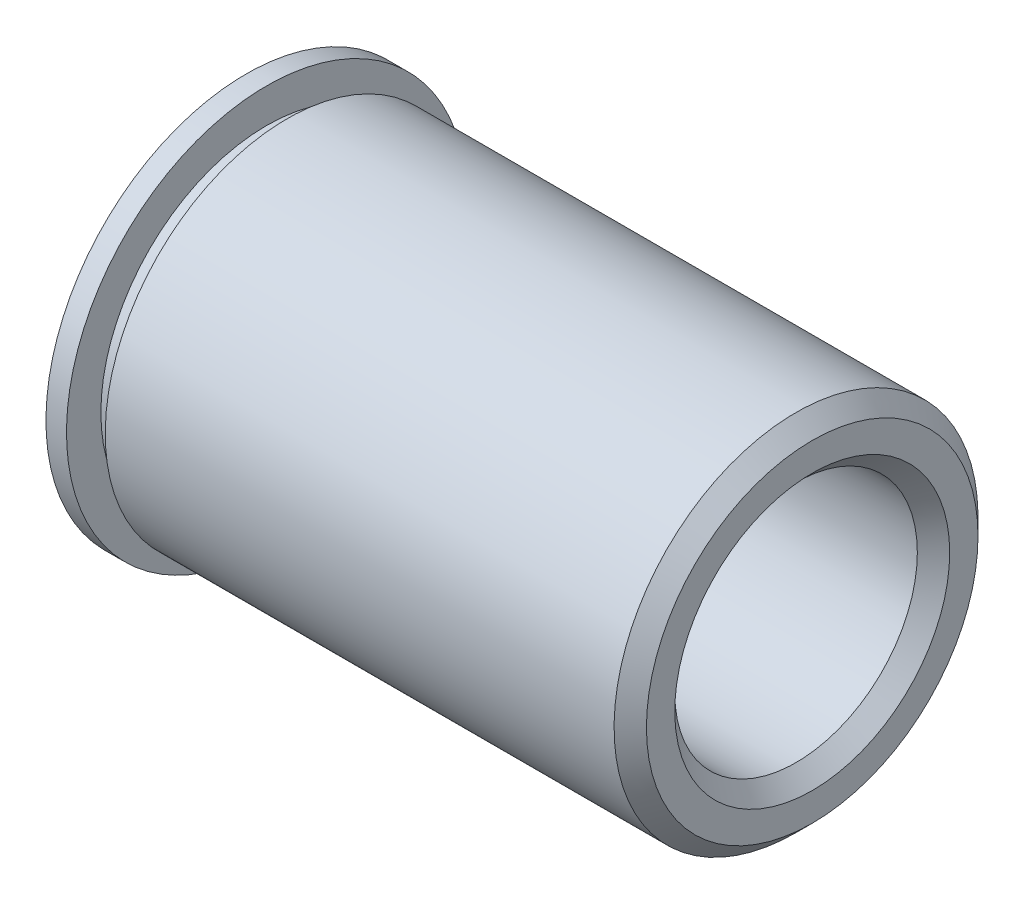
ISO-10303-21;
HEADER;
FILE_DESCRIPTION(('STEP AP214'),'2;1');
FILE_NAME('part.step','',(''),(''),'','','');
FILE_SCHEMA(('AUTOMOTIVE_DESIGN { 1 0 10303 214 1 1 1 1 }'));
ENDSEC;
DATA;
#1=APPLICATION_CONTEXT('core data for automotive mechanical design processes');
#2=APPLICATION_PROTOCOL_DEFINITION('international standard','automotive_design',2000,#1);
#3=PRODUCT_CONTEXT('',#1,'mechanical');
#4=PRODUCT('Part','Part','',(#3));
#5=PRODUCT_RELATED_PRODUCT_CATEGORY('part','',(#4));
#6=PRODUCT_DEFINITION_FORMATION('','',#4);
#7=PRODUCT_DEFINITION_CONTEXT('part definition',#1,'design');
#8=PRODUCT_DEFINITION('design','',#6,#7);
#9=PRODUCT_DEFINITION_SHAPE('','',#8);
#10=(LENGTH_UNIT() NAMED_UNIT(*) SI_UNIT(.MILLI.,.METRE.));
#11=(NAMED_UNIT(*) PLANE_ANGLE_UNIT() SI_UNIT($,.RADIAN.));
#12=(NAMED_UNIT(*) SI_UNIT($,.STERADIAN.) SOLID_ANGLE_UNIT());
#13=UNCERTAINTY_MEASURE_WITH_UNIT(LENGTH_MEASURE(1.E-05),#10,'distance_accuracy_value','');
#14=(GEOMETRIC_REPRESENTATION_CONTEXT(3) GLOBAL_UNCERTAINTY_ASSIGNED_CONTEXT((#13)) GLOBAL_UNIT_ASSIGNED_CONTEXT((#10,
#11,#12)) REPRESENTATION_CONTEXT('',''));
#15=CARTESIAN_POINT('',(0.,0.,0.));
#16=DIRECTION('',(0.,0.,1.));
#17=DIRECTION('',(1.,0.,0.));
#18=AXIS2_PLACEMENT_3D('',#15,#16,#17);
#19=CARTESIAN_POINT('',(76.2136725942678,0.,0.));
#20=DIRECTION('',(-1.,0.,0.));
#21=DIRECTION('',(0.,-1.,0.));
#22=AXIS2_PLACEMENT_3D('',#19,#20,#21);
#23=PLANE('',#22);
#24=CARTESIAN_POINT('',(76.2136725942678,0.,0.));
#25=DIRECTION('',(-1.,0.,0.));
#26=DIRECTION('',(0.,-1.,0.));
#27=AXIS2_PLACEMENT_3D('',#24,#25,#26);
#28=CIRCLE('',#27,1.7);
#29=CARTESIAN_POINT('',(76.2136725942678,-1.7,0.));
#30=VERTEX_POINT('',#29);
#31=EDGE_CURVE('E10',#30,#30,#28,.T.);
#32=ORIENTED_EDGE('',*,*,#31,.T.);
#33=EDGE_LOOP('',(#32));
#34=FACE_BOUND('',#33,.T.);
#35=CARTESIAN_POINT('',(76.2136725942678,0.,0.));
#36=DIRECTION('',(-1.,0.,0.));
#37=DIRECTION('',(0.,-1.,0.));
#38=AXIS2_PLACEMENT_3D('',#35,#36,#37);
#39=CIRCLE('',#38,2.04999999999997);
#40=CARTESIAN_POINT('',(76.2136725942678,-2.04999999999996,0.));
#41=VERTEX_POINT('',#40);
#42=EDGE_CURVE('E52',#41,#41,#39,.F.);
#43=ORIENTED_EDGE('',*,*,#42,.T.);
#44=EDGE_LOOP('',(#43));
#45=FACE_BOUND('',#44,.T.);
#46=ADVANCED_FACE('F32',(#34,#45),#23,.F.);
#47=CARTESIAN_POINT('',(-67.8249023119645,0.,0.));
#48=DIRECTION('',(-1.,0.,0.));
#49=DIRECTION('',(0.,-1.,0.));
#50=AXIS2_PLACEMENT_3D('',#47,#48,#49);
#51=CYLINDRICAL_SURFACE('',#50,2.25);
#52=CARTESIAN_POINT('',(76.0136725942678,0.,0.));
#53=DIRECTION('',(-1.,0.,0.));
#54=DIRECTION('',(0.,-1.,0.));
#55=AXIS2_PLACEMENT_3D('',#52,#53,#54);
#56=CIRCLE('',#55,2.25);
#57=CARTESIAN_POINT('',(76.0136725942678,-2.24999999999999,0.));
#58=VERTEX_POINT('',#57);
#59=EDGE_CURVE('E55',#58,#58,#56,.T.);
#60=ORIENTED_EDGE('',*,*,#59,.T.);
#61=EDGE_LOOP('',(#60));
#62=FACE_BOUND('',#61,.T.);
#63=CARTESIAN_POINT('',(69.7216725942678,0.,0.));
#64=DIRECTION('',(-1.,0.,0.));
#65=DIRECTION('',(0.,-1.,0.));
#66=AXIS2_PLACEMENT_3D('',#63,#64,#65);
#67=CIRCLE('',#66,2.25);
#68=CARTESIAN_POINT('',(69.7216725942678,-2.25,0.));
#69=VERTEX_POINT('',#68);
#70=EDGE_CURVE('E58',#69,#69,#67,.T.);
#71=ORIENTED_EDGE('',*,*,#70,.F.);
#72=EDGE_LOOP('',(#71));
#73=FACE_BOUND('',#72,.T.);
#74=ADVANCED_FACE('F97',(#62,#73),#51,.T.);
#75=CARTESIAN_POINT('',(69.7216725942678,2.25,0.));
#76=DIRECTION('',(1.,0.,0.));
#77=DIRECTION('',(0.,1.,0.));
#78=AXIS2_PLACEMENT_3D('',#75,#76,#77);
#79=PLANE('',#78);
#80=CARTESIAN_POINT('',(69.7216725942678,0.,0.));
#81=DIRECTION('',(-1.,0.,0.));
#82=DIRECTION('',(0.,-1.,0.));
#83=AXIS2_PLACEMENT_3D('',#80,#81,#82);
#84=CIRCLE('',#83,2.05);
#85=CARTESIAN_POINT('',(69.7216725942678,-2.05,0.));
#86=VERTEX_POINT('',#85);
#87=EDGE_CURVE('E61',#86,#86,#84,.T.);
#88=ORIENTED_EDGE('',*,*,#87,.F.);
#89=EDGE_LOOP('',(#88));
#90=FACE_BOUND('',#89,.T.);
#91=ORIENTED_EDGE('',*,*,#70,.T.);
#92=EDGE_LOOP('',(#91));
#93=FACE_BOUND('',#92,.T.);
#94=ADVANCED_FACE('F91',(#90,#93),#79,.F.);
#95=CARTESIAN_POINT('',(-67.8249023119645,0.,0.));
#96=DIRECTION('',(-1.,0.,0.));
#97=DIRECTION('',(0.,-1.,0.));
#98=AXIS2_PLACEMENT_3D('',#95,#96,#97);
#99=CYLINDRICAL_SURFACE('',#98,2.05);
#100=CARTESIAN_POINT('',(69.4676725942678,0.,0.));
#101=DIRECTION('',(-1.,0.,0.));
#102=DIRECTION('',(0.,-1.,0.));
#103=AXIS2_PLACEMENT_3D('',#100,#101,#102);
#104=CIRCLE('',#103,2.05);
#105=CARTESIAN_POINT('',(69.4676725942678,-2.05,0.));
#106=VERTEX_POINT('',#105);
#107=EDGE_CURVE('E64',#106,#106,#104,.T.);
#108=ORIENTED_EDGE('',*,*,#107,.F.);
#109=EDGE_LOOP('',(#108));
#110=FACE_BOUND('',#109,.T.);
#111=ORIENTED_EDGE('',*,*,#87,.T.);
#112=EDGE_LOOP('',(#111));
#113=FACE_BOUND('',#112,.T.);
#114=ADVANCED_FACE('F85',(#110,#113),#99,.T.);
#115=CARTESIAN_POINT('',(69.4676725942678,2.05,0.));
#116=DIRECTION('',(-1.,0.,0.));
#117=DIRECTION('',(0.,-1.,0.));
#118=AXIS2_PLACEMENT_3D('',#115,#116,#117);
#119=PLANE('',#118);
#120=CARTESIAN_POINT('',(69.4676725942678,0.,0.));
#121=DIRECTION('',(-1.,0.,0.));
#122=DIRECTION('',(0.,-1.,0.));
#123=AXIS2_PLACEMENT_3D('',#120,#121,#122);
#124=CIRCLE('',#123,2.475);
#125=CARTESIAN_POINT('',(69.4676725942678,-2.475,0.));
#126=VERTEX_POINT('',#125);
#127=EDGE_CURVE('E67',#126,#126,#124,.T.);
#128=ORIENTED_EDGE('',*,*,#127,.F.);
#129=EDGE_LOOP('',(#128));
#130=FACE_BOUND('',#129,.T.);
#131=ORIENTED_EDGE('',*,*,#107,.T.);
#132=EDGE_LOOP('',(#131));
#133=FACE_BOUND('',#132,.T.);
#134=ADVANCED_FACE('F79',(#130,#133),#119,.F.);
#135=CARTESIAN_POINT('',(-67.8249023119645,0.,0.));
#136=DIRECTION('',(-1.,0.,0.));
#137=DIRECTION('',(0.,-1.,0.));
#138=AXIS2_PLACEMENT_3D('',#135,#136,#137);
#139=CYLINDRICAL_SURFACE('',#138,2.475);
#140=CARTESIAN_POINT('',(69.2136725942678,0.,0.));
#141=DIRECTION('',(-1.,0.,0.));
#142=DIRECTION('',(0.,-1.,0.));
#143=AXIS2_PLACEMENT_3D('',#140,#141,#142);
#144=CIRCLE('',#143,2.475);
#145=CARTESIAN_POINT('',(69.2136725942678,-2.475,0.));
#146=VERTEX_POINT('',#145);
#147=EDGE_CURVE('E70',#146,#146,#144,.T.);
#148=ORIENTED_EDGE('',*,*,#147,.F.);
#149=EDGE_LOOP('',(#148));
#150=FACE_BOUND('',#149,.T.);
#151=ORIENTED_EDGE('',*,*,#127,.T.);
#152=EDGE_LOOP('',(#151));
#153=FACE_BOUND('',#152,.T.);
#154=ADVANCED_FACE('F76',(#150,#153),#139,.T.);
#155=CARTESIAN_POINT('',(69.2136725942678,2.475,0.));
#156=DIRECTION('',(1.,0.,0.));
#157=DIRECTION('',(0.,1.,0.));
#158=AXIS2_PLACEMENT_3D('',#155,#156,#157);
#159=PLANE('',#158);
#160=CARTESIAN_POINT('',(69.2136725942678,0.,0.));
#161=DIRECTION('',(1.,0.,0.));
#162=DIRECTION('',(0.,1.,0.));
#163=AXIS2_PLACEMENT_3D('',#160,#161,#162);
#164=CIRCLE('',#163,1.7);
#165=CARTESIAN_POINT('',(69.2136725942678,1.7,0.));
#166=VERTEX_POINT('',#165);
#167=EDGE_CURVE('E47',#166,#166,#164,.T.);
#168=ORIENTED_EDGE('',*,*,#167,.T.);
#169=EDGE_LOOP('',(#168));
#170=FACE_BOUND('',#169,.T.);
#171=ORIENTED_EDGE('',*,*,#147,.T.);
#172=EDGE_LOOP('',(#171));
#173=FACE_BOUND('',#172,.T.);
#174=ADVANCED_FACE('F74',(#170,#173),#159,.F.);
#175=CARTESIAN_POINT('',(69.2136725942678,0.,0.));
#176=DIRECTION('',(1.,0.,0.));
#177=DIRECTION('',(0.,0.,-1.));
#178=AXIS2_PLACEMENT_3D('',#175,#176,#177);
#179=CYLINDRICAL_SURFACE('',#178,1.5);
#180=CARTESIAN_POINT('',(69.4136725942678,0.,0.));
#181=DIRECTION('',(1.,0.,0.));
#182=DIRECTION('',(0.,0.,-1.));
#183=AXIS2_PLACEMENT_3D('',#180,#181,#182);
#184=CIRCLE('',#183,1.5);
#185=CARTESIAN_POINT('',(69.4136725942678,0.,-1.5));
#186=VERTEX_POINT('',#185);
#187=EDGE_CURVE('E39',#186,#186,#184,.F.);
#188=CARTESIAN_POINT('',(76.0136725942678,0.,0.));
#189=DIRECTION('',(-1.,0.,0.));
#190=DIRECTION('',(0.,0.,1.));
#191=AXIS2_PLACEMENT_3D('',#188,#189,#190);
#192=CIRCLE('',#191,1.5);
#193=CARTESIAN_POINT('',(76.0136725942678,0.,-1.5));
#194=VERTEX_POINT('',#193);
#195=EDGE_CURVE('E43',#194,#194,#192,.F.);
#196=CARTESIAN_POINT('',(69.4136725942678,0.,-1.5));
#197=CARTESIAN_POINT('',(69.4824225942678,0.,-1.5));
#198=CARTESIAN_POINT('',(69.5511725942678,0.,-1.5));
#199=CARTESIAN_POINT('',(69.6886725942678,0.,-1.5));
#200=CARTESIAN_POINT('',(69.7574225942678,0.,-1.5));
#201=CARTESIAN_POINT('',(69.8949225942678,0.,-1.5));
#202=CARTESIAN_POINT('',(69.9636725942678,0.,-1.5));
#203=CARTESIAN_POINT('',(70.1011725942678,0.,-1.5));
#204=CARTESIAN_POINT('',(70.1699225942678,0.,-1.5));
#205=CARTESIAN_POINT('',(70.3074225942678,0.,-1.5));
#206=CARTESIAN_POINT('',(70.3761725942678,0.,-1.5));
#207=CARTESIAN_POINT('',(70.5136725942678,0.,-1.5));
#208=CARTESIAN_POINT('',(70.5824225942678,0.,-1.5));
#209=CARTESIAN_POINT('',(70.7199225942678,0.,-1.5));
#210=CARTESIAN_POINT('',(70.7886725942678,0.,-1.5));
#211=CARTESIAN_POINT('',(70.9261725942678,0.,-1.5));
#212=CARTESIAN_POINT('',(70.9949225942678,0.,-1.5));
#213=CARTESIAN_POINT('',(71.1324225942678,0.,-1.5));
#214=CARTESIAN_POINT('',(71.2011725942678,0.,-1.5));
#215=CARTESIAN_POINT('',(71.3386725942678,0.,-1.5));
#216=CARTESIAN_POINT('',(71.4074225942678,0.,-1.5));
#217=CARTESIAN_POINT('',(71.5449225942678,0.,-1.5));
#218=CARTESIAN_POINT('',(71.6136725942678,0.,-1.5));
#219=CARTESIAN_POINT('',(71.7511725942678,0.,-1.5));
#220=CARTESIAN_POINT('',(71.8199225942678,0.,-1.5));
#221=CARTESIAN_POINT('',(71.9574225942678,0.,-1.5));
#222=CARTESIAN_POINT('',(72.0261725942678,0.,-1.5));
#223=CARTESIAN_POINT('',(72.1636725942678,0.,-1.5));
#224=CARTESIAN_POINT('',(72.2324225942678,0.,-1.5));
#225=CARTESIAN_POINT('',(72.3699225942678,0.,-1.5));
#226=CARTESIAN_POINT('',(72.4386725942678,0.,-1.5));
#227=CARTESIAN_POINT('',(72.5761725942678,0.,-1.5));
#228=CARTESIAN_POINT('',(72.6449225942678,0.,-1.5));
#229=CARTESIAN_POINT('',(72.7824225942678,0.,-1.5));
#230=CARTESIAN_POINT('',(72.8511725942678,0.,-1.5));
#231=CARTESIAN_POINT('',(72.9886725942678,0.,-1.5));
#232=CARTESIAN_POINT('',(73.0574225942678,0.,-1.5));
#233=CARTESIAN_POINT('',(73.1949225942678,0.,-1.5));
#234=CARTESIAN_POINT('',(73.2636725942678,0.,-1.5));
#235=CARTESIAN_POINT('',(73.4011725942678,0.,-1.5));
#236=CARTESIAN_POINT('',(73.4699225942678,0.,-1.5));
#237=CARTESIAN_POINT('',(73.6074225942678,0.,-1.5));
#238=CARTESIAN_POINT('',(73.6761725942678,0.,-1.5));
#239=CARTESIAN_POINT('',(73.8136725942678,0.,-1.5));
#240=CARTESIAN_POINT('',(73.8824225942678,0.,-1.5));
#241=CARTESIAN_POINT('',(74.0199225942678,0.,-1.5));
#242=CARTESIAN_POINT('',(74.0886725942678,0.,-1.5));
#243=CARTESIAN_POINT('',(74.2261725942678,0.,-1.5));
#244=CARTESIAN_POINT('',(74.2949225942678,0.,-1.5));
#245=CARTESIAN_POINT('',(74.4324225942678,0.,-1.5));
#246=CARTESIAN_POINT('',(74.5011725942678,0.,-1.5));
#247=CARTESIAN_POINT('',(74.6386725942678,0.,-1.5));
#248=CARTESIAN_POINT('',(74.7074225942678,0.,-1.5));
#249=CARTESIAN_POINT('',(74.8449225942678,0.,-1.5));
#250=CARTESIAN_POINT('',(74.9136725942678,0.,-1.5));
#251=CARTESIAN_POINT('',(75.0511725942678,0.,-1.5));
#252=CARTESIAN_POINT('',(75.1199225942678,0.,-1.5));
#253=CARTESIAN_POINT('',(75.2574225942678,0.,-1.5));
#254=CARTESIAN_POINT('',(75.3261725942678,0.,-1.5));
#255=CARTESIAN_POINT('',(75.4636725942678,0.,-1.5));
#256=CARTESIAN_POINT('',(75.5324225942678,0.,-1.5));
#257=CARTESIAN_POINT('',(75.6699225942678,0.,-1.5));
#258=CARTESIAN_POINT('',(75.7386725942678,0.,-1.5));
#259=CARTESIAN_POINT('',(75.8761725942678,0.,-1.5));
#260=CARTESIAN_POINT('',(75.9449225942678,0.,-1.5));
#261=CARTESIAN_POINT('',(76.0136725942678,0.,-1.5));
#262=B_SPLINE_CURVE_WITH_KNOTS('',3,(#196,#197,#198,#199,#200,#201,#202,#203,#204,#205,#206,
#207,#208,#209,#210,#211,#212,#213,#214,#215,#216,#217,#218,#219,#220,#221,#222,#223,#224,#225,
#226,#227,#228,#229,#230,#231,#232,#233,#234,#235,#236,#237,#238,#239,#240,#241,#242,#243,#244,
#245,#246,#247,#248,#249,#250,#251,#252,#253,#254,#255,#256,#257,#258,#259,#260,#261),
.UNSPECIFIED.,.F.,.F.,(4,2,2,2,2,2,2,2,2,2,2,2,2,2,2,2,2,2,2,2,2,2,2,2,2,2,2,2,2,2,2,2,4),(0.,
0.206250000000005,0.41250000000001,0.618750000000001,0.825000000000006,1.03125000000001,1.2375,
1.44375000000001,1.65000000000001,1.85625,2.06250000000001,2.26875000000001,2.475,
2.68125000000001,2.88750000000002,3.09375000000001,3.30000000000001,3.50625000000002,
3.71250000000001,3.91875000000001,4.12500000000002,4.33125000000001,4.53750000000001,
4.74375000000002,4.95000000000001,5.15625000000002,5.36250000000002,5.56875000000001,
5.77500000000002,5.98125000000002,6.18750000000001,6.39375000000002,6.60000000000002),.UNSPECIFIED.);
#263=EDGE_CURVE('BSEAM112',#186,#194,#262,.T.);
#264=ORIENTED_EDGE('',*,*,#187,.T.);
#265=ORIENTED_EDGE('',*,*,#195,.T.);
#266=ORIENTED_EDGE('',*,*,#263,.T.);
#267=ORIENTED_EDGE('',*,*,#263,.F.);
#268=EDGE_LOOP('',(#264,#266,#265,#267));
#269=FACE_BOUND('',#268,.T.);
#270=ADVANCED_FACE('F112',(#269),#179,.F.);
#271=CARTESIAN_POINT('',(76.0136725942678,0.,0.));
#272=DIRECTION('',(-1.,0.,0.));
#273=DIRECTION('',(0.,-1.,0.));
#274=AXIS2_PLACEMENT_3D('',#271,#272,#273);
#275=CONICAL_SURFACE('',#274,2.25,0.785398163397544);
#276=CARTESIAN_POINT('',(76.2136725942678,-2.04999999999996,0.));
#277=CARTESIAN_POINT('',(76.2115892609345,-2.05208333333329,0.));
#278=CARTESIAN_POINT('',(76.2095059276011,-2.05416666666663,0.));
#279=CARTESIAN_POINT('',(76.2053392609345,-2.0583333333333,0.));
#280=CARTESIAN_POINT('',(76.2032559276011,-2.06041666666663,0.));
#281=CARTESIAN_POINT('',(76.1990892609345,-2.0645833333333,0.));
#282=CARTESIAN_POINT('',(76.1970059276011,-2.06666666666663,0.));
#283=CARTESIAN_POINT('',(76.1928392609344,-2.0708333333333,0.));
#284=CARTESIAN_POINT('',(76.1907559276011,-2.07291666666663,0.));
#285=CARTESIAN_POINT('',(76.1865892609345,-2.0770833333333,0.));
#286=CARTESIAN_POINT('',(76.1845059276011,-2.07916666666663,0.));
#287=CARTESIAN_POINT('',(76.1803392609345,-2.0833333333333,0.));
#288=CARTESIAN_POINT('',(76.1782559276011,-2.08541666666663,0.));
#289=CARTESIAN_POINT('',(76.1740892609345,-2.0895833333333,0.));
#290=CARTESIAN_POINT('',(76.1720059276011,-2.09166666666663,0.));
#291=CARTESIAN_POINT('',(76.1678392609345,-2.0958333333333,0.));
#292=CARTESIAN_POINT('',(76.1657559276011,-2.09791666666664,0.));
#293=CARTESIAN_POINT('',(76.1615892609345,-2.1020833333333,0.));
#294=CARTESIAN_POINT('',(76.1595059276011,-2.10416666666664,0.));
#295=CARTESIAN_POINT('',(76.1553392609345,-2.1083333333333,0.));
#296=CARTESIAN_POINT('',(76.1532559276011,-2.11041666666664,0.));
#297=CARTESIAN_POINT('',(76.1490892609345,-2.1145833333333,0.));
#298=CARTESIAN_POINT('',(76.1470059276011,-2.11666666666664,0.));
#299=CARTESIAN_POINT('',(76.1428392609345,-2.12083333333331,0.));
#300=CARTESIAN_POINT('',(76.1407559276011,-2.12291666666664,0.));
#301=CARTESIAN_POINT('',(76.1365892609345,-2.12708333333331,0.));
#302=CARTESIAN_POINT('',(76.1345059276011,-2.12916666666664,0.));
#303=CARTESIAN_POINT('',(76.1303392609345,-2.13333333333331,0.));
#304=CARTESIAN_POINT('',(76.1282559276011,-2.13541666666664,0.));
#305=CARTESIAN_POINT('',(76.1240892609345,-2.13958333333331,0.));
#306=CARTESIAN_POINT('',(76.1220059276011,-2.14166666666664,0.));
#307=CARTESIAN_POINT('',(76.1178392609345,-2.14583333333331,0.));
#308=CARTESIAN_POINT('',(76.1157559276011,-2.14791666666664,0.));
#309=CARTESIAN_POINT('',(76.1115892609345,-2.15208333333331,0.));
#310=CARTESIAN_POINT('',(76.1095059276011,-2.15416666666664,0.));
#311=CARTESIAN_POINT('',(76.1053392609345,-2.15833333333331,0.));
#312=CARTESIAN_POINT('',(76.1032559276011,-2.16041666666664,0.));
#313=CARTESIAN_POINT('',(76.0990892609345,-2.16458333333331,0.));
#314=CARTESIAN_POINT('',(76.0970059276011,-2.16666666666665,0.));
#315=CARTESIAN_POINT('',(76.0928392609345,-2.17083333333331,0.));
#316=CARTESIAN_POINT('',(76.0907559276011,-2.17291666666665,0.));
#317=CARTESIAN_POINT('',(76.0865892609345,-2.17708333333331,0.));
#318=CARTESIAN_POINT('',(76.0845059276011,-2.17916666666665,0.));
#319=CARTESIAN_POINT('',(76.0803392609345,-2.18333333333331,0.));
#320=CARTESIAN_POINT('',(76.0782559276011,-2.18541666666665,0.));
#321=CARTESIAN_POINT('',(76.0740892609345,-2.18958333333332,0.));
#322=CARTESIAN_POINT('',(76.0720059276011,-2.19166666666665,0.));
#323=CARTESIAN_POINT('',(76.0678392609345,-2.19583333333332,0.));
#324=CARTESIAN_POINT('',(76.0657559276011,-2.19791666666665,0.));
#325=CARTESIAN_POINT('',(76.0615892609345,-2.20208333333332,0.));
#326=CARTESIAN_POINT('',(76.0595059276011,-2.20416666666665,0.));
#327=CARTESIAN_POINT('',(76.0553392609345,-2.20833333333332,0.));
#328=CARTESIAN_POINT('',(76.0532559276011,-2.21041666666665,0.));
#329=CARTESIAN_POINT('',(76.0490892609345,-2.21458333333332,0.));
#330=CARTESIAN_POINT('',(76.0470059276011,-2.21666666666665,0.));
#331=CARTESIAN_POINT('',(76.0428392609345,-2.22083333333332,0.));
#332=CARTESIAN_POINT('',(76.0407559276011,-2.22291666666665,0.));
#333=CARTESIAN_POINT('',(76.0365892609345,-2.22708333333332,0.));
#334=CARTESIAN_POINT('',(76.0345059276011,-2.22916666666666,0.));
#335=CARTESIAN_POINT('',(76.0303392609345,-2.23333333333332,0.));
#336=CARTESIAN_POINT('',(76.0282559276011,-2.23541666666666,0.));
#337=CARTESIAN_POINT('',(76.0240892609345,-2.23958333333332,0.));
#338=CARTESIAN_POINT('',(76.0220059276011,-2.24166666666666,0.));
#339=CARTESIAN_POINT('',(76.0178392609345,-2.24583333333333,0.));
#340=CARTESIAN_POINT('',(76.0157559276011,-2.24791666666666,0.));
#341=CARTESIAN_POINT('',(76.0136725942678,-2.24999999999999,0.));
#342=B_SPLINE_CURVE_WITH_KNOTS('',3,(#276,#277,#278,#279,#280,#281,#282,#283,#284,#285,#286,
#287,#288,#289,#290,#291,#292,#293,#294,#295,#296,#297,#298,#299,#300,#301,#302,#303,#304,#305,
#306,#307,#308,#309,#310,#311,#312,#313,#314,#315,#316,#317,#318,#319,#320,#321,#322,#323,#324,
#325,#326,#327,#328,#329,#330,#331,#332,#333,#334,#335,#336,#337,#338,#339,#340,#341),
.UNSPECIFIED.,.F.,.F.,(4,2,2,2,2,2,2,2,2,2,2,2,2,2,2,2,2,2,2,2,2,2,2,2,2,2,2,2,2,2,2,2,4),(0.,
0.00883883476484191,0.0176776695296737,0.0265165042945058,0.0353553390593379,0.04419417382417,
0.0530330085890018,0.0618718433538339,0.070710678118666,0.0795495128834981,0.0883883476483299,
0.097227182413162,0.106066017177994,0.114904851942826,0.123743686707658,0.13258252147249,
0.141421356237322,0.150260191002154,0.159099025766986,0.167937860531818,0.17677669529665,
0.185615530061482,0.194454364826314,0.203293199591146,0.212132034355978,0.22097086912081,
0.229809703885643,0.238648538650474,0.247487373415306,0.256326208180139,0.265165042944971,
0.274003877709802,0.282842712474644),.UNSPECIFIED.);
#343=EDGE_CURVE('BSEAM109',#41,#58,#342,.T.);
#344=ORIENTED_EDGE('',*,*,#42,.F.);
#345=ORIENTED_EDGE('',*,*,#59,.F.);
#346=ORIENTED_EDGE('',*,*,#343,.T.);
#347=ORIENTED_EDGE('',*,*,#343,.F.);
#348=EDGE_LOOP('',(#344,#346,#345,#347));
#349=FACE_BOUND('',#348,.T.);
#350=ADVANCED_FACE('F109',(#349),#275,.T.);
#351=CARTESIAN_POINT('',(69.2136725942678,0.,0.));
#352=DIRECTION('',(-1.,0.,0.));
#353=DIRECTION('',(0.,0.,1.));
#354=AXIS2_PLACEMENT_3D('',#351,#352,#353);
#355=CONICAL_SURFACE('',#354,1.7,0.785398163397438);
#356=ORIENTED_EDGE('',*,*,#187,.F.);
#357=EDGE_LOOP('',(#356));
#358=FACE_BOUND('',#357,.T.);
#359=ORIENTED_EDGE('',*,*,#167,.F.);
#360=EDGE_LOOP('',(#359));
#361=FACE_BOUND('',#360,.T.);
#362=ADVANCED_FACE('F111',(#358,#361),#355,.F.);
#363=CARTESIAN_POINT('',(76.0136725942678,0.,0.));
#364=DIRECTION('',(1.,0.,0.));
#365=DIRECTION('',(0.,0.,-1.));
#366=AXIS2_PLACEMENT_3D('',#363,#364,#365);
#367=CONICAL_SURFACE('',#366,1.5,0.785398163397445);
#368=ORIENTED_EDGE('',*,*,#31,.F.);
#369=EDGE_LOOP('',(#368));
#370=FACE_BOUND('',#369,.T.);
#371=ORIENTED_EDGE('',*,*,#195,.F.);
#372=EDGE_LOOP('',(#371));
#373=FACE_BOUND('',#372,.T.);
#374=ADVANCED_FACE('F34',(#370,#373),#367,.F.);
#375=CLOSED_SHELL('',(#46,#74,#94,#114,#134,#154,#174,#270,#350,#362,#374));
#376=MANIFOLD_SOLID_BREP('B2',#375);
#377=ADVANCED_BREP_SHAPE_REPRESENTATION('',(#18,#376),#14);
#378=SHAPE_DEFINITION_REPRESENTATION(#9,#377);
ENDSEC;
END-ISO-10303-21;
